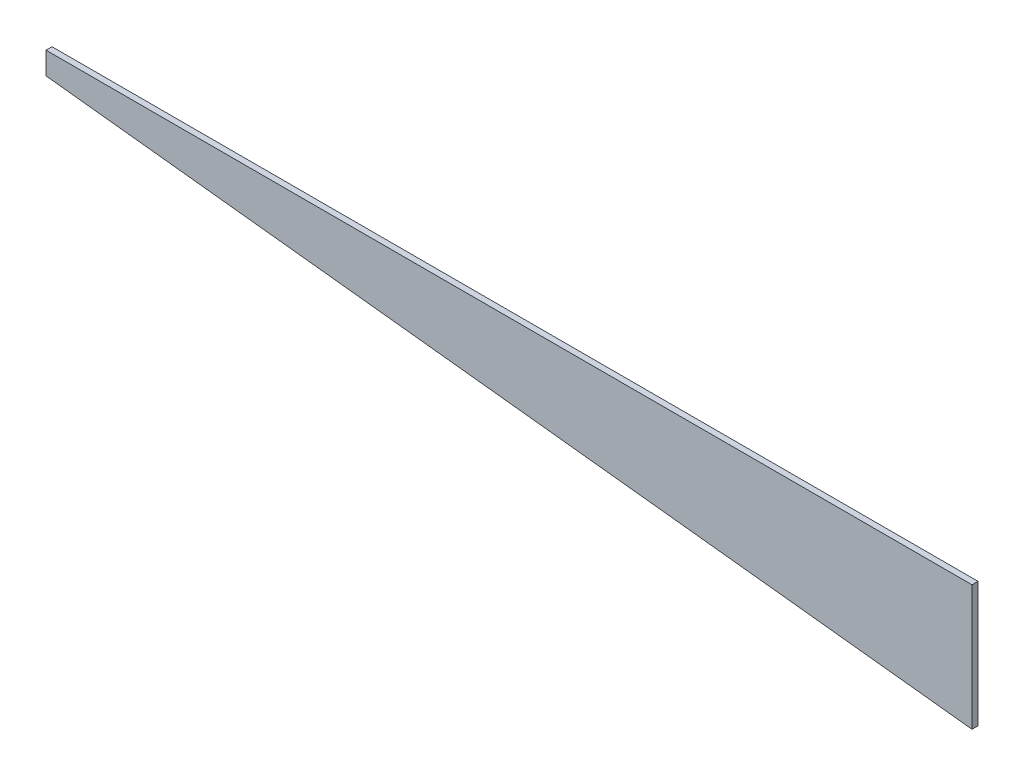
ISO-10303-21;
HEADER;
FILE_DESCRIPTION(('STEP AP214'),'2;1');
FILE_NAME('part.step','',(''),(''),'','','');
FILE_SCHEMA(('AUTOMOTIVE_DESIGN { 1 0 10303 214 1 1 1 1 }'));
ENDSEC;
DATA;
#1=APPLICATION_CONTEXT('core data for automotive mechanical design processes');
#2=APPLICATION_PROTOCOL_DEFINITION('international standard','automotive_design',2000,#1);
#3=PRODUCT_CONTEXT('',#1,'mechanical');
#4=PRODUCT('Part','Part','',(#3));
#5=PRODUCT_RELATED_PRODUCT_CATEGORY('part','',(#4));
#6=PRODUCT_DEFINITION_FORMATION('','',#4);
#7=PRODUCT_DEFINITION_CONTEXT('part definition',#1,'design');
#8=PRODUCT_DEFINITION('design','',#6,#7);
#9=PRODUCT_DEFINITION_SHAPE('','',#8);
#10=(LENGTH_UNIT() NAMED_UNIT(*) SI_UNIT(.MILLI.,.METRE.));
#11=(NAMED_UNIT(*) PLANE_ANGLE_UNIT() SI_UNIT($,.RADIAN.));
#12=(NAMED_UNIT(*) SI_UNIT($,.STERADIAN.) SOLID_ANGLE_UNIT());
#13=UNCERTAINTY_MEASURE_WITH_UNIT(LENGTH_MEASURE(1.E-05),#10,'distance_accuracy_value','');
#14=(GEOMETRIC_REPRESENTATION_CONTEXT(3) GLOBAL_UNCERTAINTY_ASSIGNED_CONTEXT((#13)) GLOBAL_UNIT_ASSIGNED_CONTEXT((#10,
#11,#12)) REPRESENTATION_CONTEXT('',''));
#15=CARTESIAN_POINT('',(0.,0.,0.));
#16=DIRECTION('',(0.,0.,1.));
#17=DIRECTION('',(1.,0.,0.));
#18=AXIS2_PLACEMENT_3D('',#15,#16,#17);
#19=CARTESIAN_POINT('',(-771.525,0.,5.));
#20=DIRECTION('',(1.,0.,0.));
#21=DIRECTION('',(0.,0.,-1.));
#22=AXIS2_PLACEMENT_3D('',#19,#20,#21);
#23=PLANE('',#22);
#24=DIRECTION('',(0.,0.,1.));
#25=VECTOR('',#24,1.);
#26=CARTESIAN_POINT('',(-771.525,-10.,0.));
#27=LINE('',#26,#25);
#28=CARTESIAN_POINT('',(-771.525,-10.,0.));
#29=VERTEX_POINT('',#28);
#30=CARTESIAN_POINT('',(-771.525,-10.,5.));
#31=VERTEX_POINT('',#30);
#32=EDGE_CURVE('E109',#29,#31,#27,.T.);
#33=ORIENTED_EDGE('',*,*,#32,.F.);
#34=DIRECTION('',(0.,-1.,0.));
#35=VECTOR('',#34,1.);
#36=CARTESIAN_POINT('',(-771.525,0.,0.));
#37=LINE('',#36,#35);
#38=CARTESIAN_POINT('',(-771.525,-28.5750000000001,0.));
#39=VERTEX_POINT('',#38);
#40=EDGE_CURVE('E91',#29,#39,#37,.T.);
#41=ORIENTED_EDGE('',*,*,#40,.T.);
#42=DIRECTION('',(0.,0.,-1.));
#43=VECTOR('',#42,1.);
#44=CARTESIAN_POINT('',(-771.525,-28.5750000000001,5.));
#45=LINE('',#44,#43);
#46=CARTESIAN_POINT('',(-771.525,-28.5750000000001,5.));
#47=VERTEX_POINT('',#46);
#48=EDGE_CURVE('E11',#47,#39,#45,.T.);
#49=ORIENTED_EDGE('',*,*,#48,.F.);
#50=DIRECTION('',(0.,-1.,0.));
#51=VECTOR('',#50,1.);
#52=CARTESIAN_POINT('',(-771.525,0.,5.));
#53=LINE('',#52,#51);
#54=EDGE_CURVE('E101',#31,#47,#53,.T.);
#55=ORIENTED_EDGE('',*,*,#54,.F.);
#56=EDGE_LOOP('',(#33,#41,#49,#55));
#57=FACE_BOUND('',#56,.T.);
#58=ADVANCED_FACE('F45',(#57),#23,.F.);
#59=CARTESIAN_POINT('',(0.,0.,5.));
#60=DIRECTION('',(-1.,0.,0.));
#61=DIRECTION('',(0.,-1.,0.));
#62=AXIS2_PLACEMENT_3D('',#59,#60,#61);
#63=PLANE('',#62);
#64=DIRECTION('',(0.,0.,1.));
#65=VECTOR('',#64,1.);
#66=CARTESIAN_POINT('',(0.,-10.,0.));
#67=LINE('',#66,#65);
#68=CARTESIAN_POINT('',(0.,-10.,0.));
#69=VERTEX_POINT('',#68);
#70=CARTESIAN_POINT('',(0.,-10.,5.));
#71=VERTEX_POINT('',#70);
#72=EDGE_CURVE('E60',#69,#71,#67,.T.);
#73=ORIENTED_EDGE('',*,*,#72,.T.);
#74=DIRECTION('',(0.,1.,0.));
#75=VECTOR('',#74,1.);
#76=CARTESIAN_POINT('',(0.,0.,5.));
#77=LINE('',#76,#75);
#78=CARTESIAN_POINT('',(0.,-114.3,5.));
#79=VERTEX_POINT('',#78);
#80=EDGE_CURVE('E96',#79,#71,#77,.T.);
#81=ORIENTED_EDGE('',*,*,#80,.F.);
#82=DIRECTION('',(0.,0.,-1.));
#83=VECTOR('',#82,1.);
#84=CARTESIAN_POINT('',(0.,-114.3,5.));
#85=LINE('',#84,#83);
#86=CARTESIAN_POINT('',(0.,-114.3,0.));
#87=VERTEX_POINT('',#86);
#88=EDGE_CURVE('E53',#79,#87,#85,.T.);
#89=ORIENTED_EDGE('',*,*,#88,.T.);
#90=DIRECTION('',(0.,1.,0.));
#91=VECTOR('',#90,1.);
#92=CARTESIAN_POINT('',(0.,0.,0.));
#93=LINE('',#92,#91);
#94=EDGE_CURVE('E90',#87,#69,#93,.T.);
#95=ORIENTED_EDGE('',*,*,#94,.T.);
#96=EDGE_LOOP('',(#73,#81,#89,#95));
#97=FACE_BOUND('',#96,.T.);
#98=ADVANCED_FACE('F95',(#97),#63,.F.);
#99=CARTESIAN_POINT('',(0.,0.,5.));
#100=DIRECTION('',(0.,0.,1.));
#101=DIRECTION('',(1.,0.,0.));
#102=AXIS2_PLACEMENT_3D('',#99,#100,#101);
#103=PLANE('',#102);
#104=ORIENTED_EDGE('',*,*,#80,.T.);
#105=DIRECTION('',(-1.,0.,0.));
#106=VECTOR('',#105,1.);
#107=CARTESIAN_POINT('',(0.,-10.,5.));
#108=LINE('',#107,#106);
#109=EDGE_CURVE('E119',#71,#31,#108,.T.);
#110=ORIENTED_EDGE('',*,*,#109,.T.);
#111=ORIENTED_EDGE('',*,*,#54,.T.);
#112=DIRECTION('',(0.993883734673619,-0.110431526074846,0.));
#113=VECTOR('',#112,1.);
#114=CARTESIAN_POINT('',(-771.525,-28.5750000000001,5.));
#115=LINE('',#114,#113);
#116=EDGE_CURVE('E69',#47,#79,#115,.T.);
#117=ORIENTED_EDGE('',*,*,#116,.T.);
#118=EDGE_LOOP('',(#104,#110,#111,#117));
#119=FACE_BOUND('',#118,.T.);
#120=ADVANCED_FACE('F132',(#119),#103,.T.);
#121=CARTESIAN_POINT('',(0.,0.,0.));
#122=DIRECTION('',(0.,0.,1.));
#123=DIRECTION('',(1.,0.,0.));
#124=AXIS2_PLACEMENT_3D('',#121,#122,#123);
#125=PLANE('',#124);
#126=DIRECTION('',(-1.,0.,0.));
#127=VECTOR('',#126,1.);
#128=CARTESIAN_POINT('',(0.,-10.,0.));
#129=LINE('',#128,#127);
#130=EDGE_CURVE('E99',#69,#29,#129,.T.);
#131=ORIENTED_EDGE('',*,*,#130,.F.);
#132=ORIENTED_EDGE('',*,*,#94,.F.);
#133=DIRECTION('',(0.993883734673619,-0.110431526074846,0.));
#134=VECTOR('',#133,1.);
#135=CARTESIAN_POINT('',(-771.525,-28.5750000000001,0.));
#136=LINE('',#135,#134);
#137=EDGE_CURVE('E81',#39,#87,#136,.T.);
#138=ORIENTED_EDGE('',*,*,#137,.F.);
#139=ORIENTED_EDGE('',*,*,#40,.F.);
#140=EDGE_LOOP('',(#131,#132,#138,#139));
#141=FACE_BOUND('',#140,.T.);
#142=ADVANCED_FACE('F98',(#141),#125,.F.);
#143=CARTESIAN_POINT('',(-771.525,-28.5750000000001,5.));
#144=DIRECTION('',(0.110431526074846,0.993883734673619,0.));
#145=DIRECTION('',(-0.993883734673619,0.110431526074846,0.));
#146=AXIS2_PLACEMENT_3D('',#143,#144,#145);
#147=PLANE('',#146);
#148=ORIENTED_EDGE('',*,*,#137,.T.);
#149=ORIENTED_EDGE('',*,*,#88,.F.);
#150=ORIENTED_EDGE('',*,*,#116,.F.);
#151=ORIENTED_EDGE('',*,*,#48,.T.);
#152=EDGE_LOOP('',(#148,#149,#150,#151));
#153=FACE_BOUND('',#152,.T.);
#154=ADVANCED_FACE('F83',(#153),#147,.F.);
#155=CARTESIAN_POINT('',(0.,-10.,0.));
#156=DIRECTION('',(0.,1.,0.));
#157=DIRECTION('',(0.,0.,1.));
#158=AXIS2_PLACEMENT_3D('',#155,#156,#157);
#159=PLANE('',#158);
#160=ORIENTED_EDGE('',*,*,#109,.F.);
#161=ORIENTED_EDGE('',*,*,#72,.F.);
#162=ORIENTED_EDGE('',*,*,#130,.T.);
#163=ORIENTED_EDGE('',*,*,#32,.T.);
#164=EDGE_LOOP('',(#160,#161,#162,#163));
#165=FACE_BOUND('',#164,.T.);
#166=ADVANCED_FACE('F126',(#165),#159,.T.);
#167=CLOSED_SHELL('',(#58,#98,#120,#142,#154,#166));
#168=MANIFOLD_SOLID_BREP('B2',#167);
#169=ADVANCED_BREP_SHAPE_REPRESENTATION('',(#18,#168),#14);
#170=SHAPE_DEFINITION_REPRESENTATION(#9,#169);
ENDSEC;
END-ISO-10303-21;
